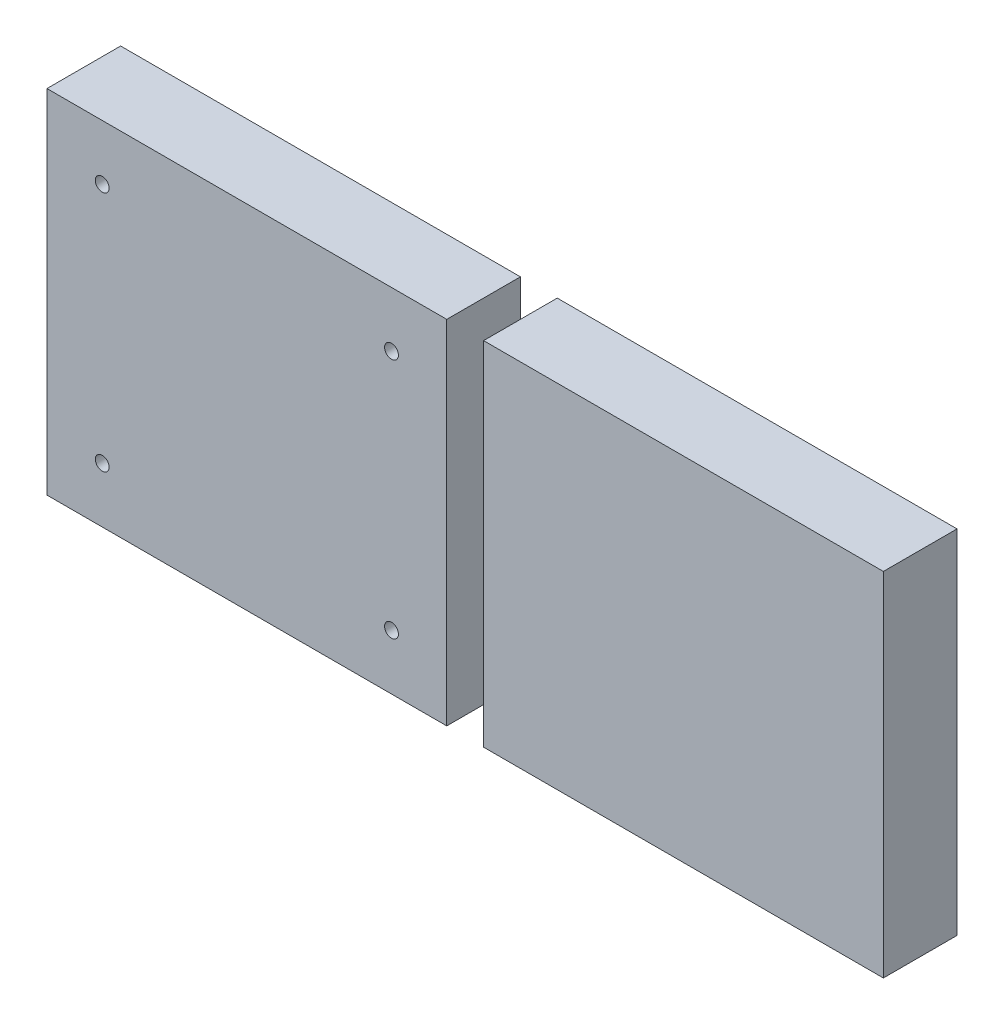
from build123d import *

# Parameters (mm, degrees)
SKETCH11_R          = 16
BOSS_EXTRUDE4_DEPTH = 8
SKETCH12_R          = 6.25
CUT_EXTRUDE10_DEPTH = 25
CUT_EXTRUDE12_DEPTH = 25
CIRPATTERN4_COUNT   = 30
SKETCH15_W          = 43.41408009
SKETCH15_H          = 38.2367488
BOSS_EXTRUDE6_DEPTH = 4
SKETCH17_W          = 43.41408009
SKETCH17_H          = 38.2367488
SKETCH17_W_2        = 39.41408009
SKETCH17_H_2        = 34.2367488
SKETCH17_R          = 0.75
BOSS_EXTRUDE7_DEPTH = 4
CUT_EXTRUDE15_START = -8
SKETCH22_R          = 0.75
CUT_EXTRUDE15_DEPTH = 8
BOSS_EXTRUDE8_DEPTH = 6.302278


with BuildPart() as part:
    # Sketch11 → Boss-Extrude4 (new body)
    with BuildSketch(Plane.XY):
        Circle(SKETCH11_R)
    extrude(amount=BOSS_EXTRUDE4_DEPTH)

    # Sketch12 → Cut-Extrude10 (cut, through all)
    with BuildSketch(Plane.XY.offset(8)):
        Circle(SKETCH12_R)
    extrude(amount=-CUT_EXTRUDE10_DEPTH, mode=Mode.SUBTRACT)

    # Sketch13 → Cut-Extrude12 (cut, through all)
    with BuildSketch(Plane.XY.offset(8)):
        with BuildLine():
            Line((-0.219874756, 13.6), (0.219874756, 13.6))
            ThreePointArc((0.219874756, 13.6), (0.421386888, 13.677754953), (0.518441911, 13.870714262))
            ThreePointArc((0.518441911, 13.870714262), (1.009154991, 15.525876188), (2.08, 16.88))
            ThreePointArc((2.08, 16.88), (0, 17.000581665), (-2.08, 16.88))
            ThreePointArc((-2.08, 16.88), (-1.009154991, 15.525876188), (-0.518441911, 13.870714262))
            ThreePointArc((-0.518441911, 13.870714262), (-0.421386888, 13.677754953), (-0.219874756, 13.6))
        make_face()
    cut_extrude12 = extrude(amount=-CUT_EXTRUDE12_DEPTH, mode=Mode.SUBTRACT)

    # CirPattern4: Cut-Extrude12 ×30 about axis
    cirpattern4_axis = Axis((0, 0, 0), (0, 0, 1))
    for i in range(1, CIRPATTERN4_COUNT):
        add(cut_extrude12.rotate(cirpattern4_axis, i * 360 / CIRPATTERN4_COUNT), mode=Mode.SUBTRACT)

    # Sketch15 → Boss-Extrude6 (add)
    with BuildSketch(Plane.XY.offset(8)):
        Rectangle(SKETCH15_W, SKETCH15_H)
    extrude(amount=-BOSS_EXTRUDE6_DEPTH)

    # Sketch17 → Boss-Extrude7 (add)
    # profile 1 of 5: a face of its own
    with BuildSketch(Plane(origin=(0, 0, 4), x_dir=(-1, 0, 0), z_dir=(0, 0, -1))):
        Rectangle(SKETCH17_W, SKETCH17_H)
        Rectangle(SKETCH17_W_2, SKETCH17_H_2, mode=Mode.SUBTRACT)
    # profile 2 of 5: a face of its own
    with BuildSketch(Plane(origin=(0, 0, 4), x_dir=(-1, 0, 0), z_dir=(0, 0, -1))):
        with Locations(Location((15.707040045, 13.1183744, 0), (0, 0, 180))):
            Circle(SKETCH17_R)
    # profile 3 of 5: a face of its own
    with BuildSketch(Plane(origin=(0, 0, 4), x_dir=(-1, 0, 0), z_dir=(0, 0, -1))):
        with Locations((15.707040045, -13.1183744)):
            Circle(SKETCH17_R)
    # profile 4 of 5: a face of its own
    with BuildSketch(Plane(origin=(0, 0, 4), x_dir=(-1, 0, 0), z_dir=(0, 0, -1))):
        with Locations(Location((-15.707040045, -13.1183744, 0), (0, 0, 180))):
            Circle(SKETCH17_R)
    # profile 5 of 5: a face of its own
    with BuildSketch(Plane(origin=(0, 0, 4), x_dir=(-1, 0, 0), z_dir=(0, 0, -1))):
        with Locations((-15.707040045, 13.1183744)):
            Circle(SKETCH17_R)
    extrude(amount=BOSS_EXTRUDE7_DEPTH)


with BuildPart() as body_2:
    # Mirror8: mirrored copy
    add(part.part.mirror(Plane.ZY.offset(23.707040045)))

    # Sketch22 → Cut-Extrude15 (cut)
    with BuildSketch(Plane(origin=(0, 0, 0), x_dir=(-1, 0, 0), z_dir=(0, 0, -1)).offset(CUT_EXTRUDE15_START)):
        with Locations((31.707040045, 13.1183744)):
            Circle(SKETCH22_R)
        with Locations((31.707040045, -13.1183744)):
            Circle(SKETCH22_R)
        with Locations((63.121120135, -13.1183744)):
            Circle(SKETCH22_R)
        with Locations((63.121120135, 13.1183744)):
            Circle(SKETCH22_R)
    extrude(amount=CUT_EXTRUDE15_DEPTH, mode=Mode.SUBTRACT)


with BuildPart() as part_1:
    add(part.part)

    add(body_2.part)  # Boss-Extrude8 merges body 2
    # Sketch23 → Boss-Extrude8 (add)
    with BuildSketch(Plane.XZ.offset(-17.1183744)):
        with BuildLine():
            Line((-41.802349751, 0), (-36.802349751, 0))
            ThreePointArc((-36.802349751, 0), (-39.302349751, 2.5), (-41.802349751, 0))
        make_face()
        with BuildLine():
            Line((-56.012299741, 0), (-51.012299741, 0))
            ThreePointArc((-51.012299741, 0), (-53.512299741, 2.5), (-56.012299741, 0))
        make_face()
        with BuildLine():
            ThreePointArc((8.598219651, 0), (6.098219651, 2.5), (3.598219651, 0))
            Line((3.598219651, 0), (8.598219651, 0))
        make_face()
        with BuildLine():
            ThreePointArc((-5.611730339, 0), (-8.111730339, 2.5), (-10.611730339, 0))
            Line((-10.611730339, 0), (-5.611730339, 0))
        make_face()
    extrude(amount=BOSS_EXTRUDE8_DEPTH)


solid = part_1.part
